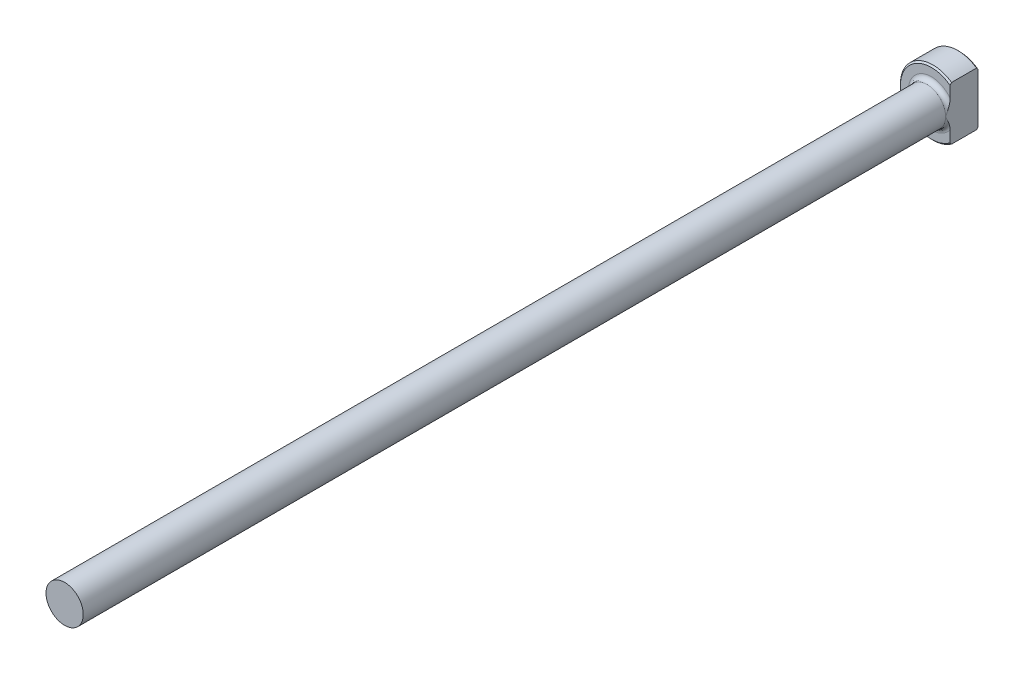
ISO-10303-21;
HEADER;
FILE_DESCRIPTION(('STEP AP214'),'2;1');
FILE_NAME('part.step','',(''),(''),'','','');
FILE_SCHEMA(('AUTOMOTIVE_DESIGN { 1 0 10303 214 1 1 1 1 }'));
ENDSEC;
DATA;
#1=APPLICATION_CONTEXT('core data for automotive mechanical design processes');
#2=APPLICATION_PROTOCOL_DEFINITION('international standard','automotive_design',2000,#1);
#3=PRODUCT_CONTEXT('',#1,'mechanical');
#4=PRODUCT('Part','Part','',(#3));
#5=PRODUCT_RELATED_PRODUCT_CATEGORY('part','',(#4));
#6=PRODUCT_DEFINITION_FORMATION('','',#4);
#7=PRODUCT_DEFINITION_CONTEXT('part definition',#1,'design');
#8=PRODUCT_DEFINITION('design','',#6,#7);
#9=PRODUCT_DEFINITION_SHAPE('','',#8);
#10=(LENGTH_UNIT() NAMED_UNIT(*) SI_UNIT(.MILLI.,.METRE.));
#11=(NAMED_UNIT(*) PLANE_ANGLE_UNIT() SI_UNIT($,.RADIAN.));
#12=(NAMED_UNIT(*) SI_UNIT($,.STERADIAN.) SOLID_ANGLE_UNIT());
#13=UNCERTAINTY_MEASURE_WITH_UNIT(LENGTH_MEASURE(1.E-05),#10,'distance_accuracy_value','');
#14=(GEOMETRIC_REPRESENTATION_CONTEXT(3) GLOBAL_UNCERTAINTY_ASSIGNED_CONTEXT((#13)) GLOBAL_UNIT_ASSIGNED_CONTEXT((#10,
#11,#12)) REPRESENTATION_CONTEXT('',''));
#15=CARTESIAN_POINT('',(0.,0.,0.));
#16=DIRECTION('',(0.,0.,1.));
#17=DIRECTION('',(1.,0.,0.));
#18=AXIS2_PLACEMENT_3D('',#15,#16,#17);
#19=CARTESIAN_POINT('',(0.,0.,0.));
#20=DIRECTION('',(0.,0.,1.));
#21=DIRECTION('',(1.,0.,0.));
#22=AXIS2_PLACEMENT_3D('',#19,#20,#21);
#23=PLANE('',#22);
#24=DIRECTION('',(0.,-1.,0.));
#25=VECTOR('',#24,1.);
#26=CARTESIAN_POINT('',(3.175,4.55200670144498,0.));
#27=LINE('',#26,#25);
#28=CARTESIAN_POINT('',(3.175,4.23862381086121,0.));
#29=VERTEX_POINT('',#28);
#30=CARTESIAN_POINT('',(3.175,-4.23862381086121,0.));
#31=VERTEX_POINT('',#30);
#32=EDGE_CURVE('E194',#29,#31,#27,.T.);
#33=ORIENTED_EDGE('',*,*,#32,.T.);
#34=CARTESIAN_POINT('',(0.,0.,0.));
#35=DIRECTION('',(0.,0.,1.));
#36=DIRECTION('',(1.,0.,0.));
#37=AXIS2_PLACEMENT_3D('',#34,#35,#36);
#38=CIRCLE('',#37,5.29589999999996);
#39=EDGE_CURVE('E11',#31,#29,#38,.F.);
#40=ORIENTED_EDGE('',*,*,#39,.T.);
#41=EDGE_LOOP('',(#33,#40));
#42=FACE_BOUND('',#41,.T.);
#43=ADVANCED_FACE('F34',(#42),#23,.F.);
#44=CARTESIAN_POINT('',(0.,0.,-2.14753999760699));
#45=DIRECTION('',(0.,0.,-1.));
#46=DIRECTION('',(-1.,0.,0.));
#47=AXIS2_PLACEMENT_3D('',#44,#45,#46);
#48=CYLINDRICAL_SURFACE('',#47,5.5499);
#49=DIRECTION('',(0.,0.,-1.));
#50=VECTOR('',#49,1.);
#51=CARTESIAN_POINT('',(3.175,-4.55200670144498,7.62));
#52=LINE('',#51,#50);
#53=CARTESIAN_POINT('',(3.175,-4.55200670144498,4.49580000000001));
#54=VERTEX_POINT('',#53);
#55=CARTESIAN_POINT('',(3.175,-4.55200670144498,0.254000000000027));
#56=VERTEX_POINT('',#55);
#57=EDGE_CURVE('E192',#54,#56,#52,.T.);
#58=ORIENTED_EDGE('',*,*,#57,.F.);
#59=CARTESIAN_POINT('',(0.,0.,4.49580000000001));
#60=DIRECTION('',(0.,0.,-1.));
#61=DIRECTION('',(-1.,0.,0.));
#62=AXIS2_PLACEMENT_3D('',#59,#60,#61);
#63=CIRCLE('',#62,5.5499);
#64=CARTESIAN_POINT('',(3.175,4.55200670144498,4.49580000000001));
#65=VERTEX_POINT('',#64);
#66=EDGE_CURVE('E111',#54,#65,#63,.T.);
#67=ORIENTED_EDGE('',*,*,#66,.T.);
#68=DIRECTION('',(0.,0.,-1.));
#69=VECTOR('',#68,1.);
#70=CARTESIAN_POINT('',(3.175,4.55200670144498,7.62));
#71=LINE('',#70,#69);
#72=CARTESIAN_POINT('',(3.175,4.55200670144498,0.254000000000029));
#73=VERTEX_POINT('',#72);
#74=EDGE_CURVE('E97',#65,#73,#71,.T.);
#75=ORIENTED_EDGE('',*,*,#74,.T.);
#76=CARTESIAN_POINT('',(0.,0.,0.254000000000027));
#77=DIRECTION('',(0.,0.,1.));
#78=DIRECTION('',(1.,0.,0.));
#79=AXIS2_PLACEMENT_3D('',#76,#77,#78);
#80=CIRCLE('',#79,5.5499);
#81=EDGE_CURVE('E108',#73,#56,#80,.T.);
#82=ORIENTED_EDGE('',*,*,#81,.T.);
#83=EDGE_LOOP('',(#58,#67,#75,#82));
#84=FACE_BOUND('',#83,.T.);
#85=ADVANCED_FACE('F170',(#84),#48,.T.);
#86=CARTESIAN_POINT('',(0.,-3.937,4.7498));
#87=DIRECTION('',(0.,0.,-1.));
#88=DIRECTION('',(-1.,0.,0.));
#89=AXIS2_PLACEMENT_3D('',#86,#87,#88);
#90=PLANE('',#89);
#91=DIRECTION('',(0.,-1.,0.));
#92=VECTOR('',#91,1.);
#93=CARTESIAN_POINT('',(3.175,-3.937,4.7498));
#94=LINE('',#93,#92);
#95=CARTESIAN_POINT('',(3.175,4.23862381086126,4.7498));
#96=VERTEX_POINT('',#95);
#97=CARTESIAN_POINT('',(3.175,2.32794845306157,4.7498));
#98=VERTEX_POINT('',#97);
#99=EDGE_CURVE('E106',#96,#98,#94,.T.);
#100=ORIENTED_EDGE('',*,*,#99,.F.);
#101=CARTESIAN_POINT('',(0.,0.,4.7498));
#102=DIRECTION('',(0.,0.,-1.));
#103=DIRECTION('',(-1.,0.,0.));
#104=AXIS2_PLACEMENT_3D('',#101,#102,#103);
#105=CIRCLE('',#104,5.29590000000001);
#106=CARTESIAN_POINT('',(3.175,-4.23862381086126,4.7498));
#107=VERTEX_POINT('',#106);
#108=EDGE_CURVE('E43',#96,#107,#105,.F.);
#109=ORIENTED_EDGE('',*,*,#108,.T.);
#110=CARTESIAN_POINT('',(3.175,-2.32794845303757,4.7498));
#111=VERTEX_POINT('',#110);
#112=EDGE_CURVE('E90',#111,#107,#94,.T.);
#113=ORIENTED_EDGE('',*,*,#112,.F.);
#114=CARTESIAN_POINT('',(0.,0.,4.7498));
#115=DIRECTION('',(0.,0.,-1.));
#116=DIRECTION('',(-1.,0.,0.));
#117=AXIS2_PLACEMENT_3D('',#114,#115,#116);
#118=CIRCLE('',#117,3.937);
#119=EDGE_CURVE('E103',#111,#98,#118,.T.);
#120=ORIENTED_EDGE('',*,*,#119,.T.);
#121=EDGE_LOOP('',(#100,#109,#113,#120));
#122=FACE_BOUND('',#121,.T.);
#123=ADVANCED_FACE('F102',(#122),#90,.F.);
#124=CARTESIAN_POINT('',(0.,0.,5.5118));
#125=DIRECTION('',(0.,0.,-1.));
#126=DIRECTION('',(-1.,0.,0.));
#127=AXIS2_PLACEMENT_3D('',#124,#125,#126);
#128=TOROIDAL_SURFACE('',#127,3.937,0.762);
#129=CARTESIAN_POINT('',(3.175,0.,5.5118));
#130=CARTESIAN_POINT('',(3.175,8.70861715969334E-12,5.51180101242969));
#131=CARTESIAN_POINT('',(3.175,1.64502537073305E-07,5.51180202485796));
#132=CARTESIAN_POINT('',(3.175,7.10670711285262E-07,5.51180399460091));
#133=CARTESIAN_POINT('',(3.175,1.09547584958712E-06,5.51180495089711));
#134=CARTESIAN_POINT('',(3.175,2.02938537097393E-06,5.51180684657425));
#135=CARTESIAN_POINT('',(3.175,2.58665029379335E-06,5.51180778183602));
#136=CARTESIAN_POINT('',(3.175,3.80677368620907E-06,5.51180957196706));
#137=CARTESIAN_POINT('',(3.175,4.46917456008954E-06,5.51181042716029));
#138=CARTESIAN_POINT('',(3.175,6.78713874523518E-06,5.51181319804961));
#139=CARTESIAN_POINT('',(3.175,8.58298314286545E-06,5.51181499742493));
#140=CARTESIAN_POINT('',(3.175,1.23554084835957E-05,5.51181828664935));
#141=CARTESIAN_POINT('',(3.175,1.43270198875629E-05,5.51181978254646));
#142=CARTESIAN_POINT('',(3.175,2.17707854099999E-05,5.51182515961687));
#143=CARTESIAN_POINT('',(3.175,2.74631079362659E-05,5.51182874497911));
#144=CARTESIAN_POINT('',(3.175,3.88864704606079E-05,5.51183483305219));
#145=CARTESIAN_POINT('',(3.175,4.45883312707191E-05,5.5118373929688));
#146=CARTESIAN_POINT('',(3.175,6.81341507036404E-05,5.51184782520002));
#147=CARTESIAN_POINT('',(3.175,8.6078631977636E-05,5.51185544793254));
#148=CARTESIAN_POINT('',(3.175,0.000120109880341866,5.51186811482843));
#149=CARTESIAN_POINT('',(3.175,0.000136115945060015,5.51187336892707));
#150=CARTESIAN_POINT('',(3.175,0.00024914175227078,5.51191372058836));
#151=CARTESIAN_POINT('',(3.175,0.000340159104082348,5.51196353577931));
#152=CARTESIAN_POINT('',(3.175,0.000689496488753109,5.51214743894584));
#153=CARTESIAN_POINT('',(3.175,0.000952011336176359,5.51227059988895));
#154=CARTESIAN_POINT('',(3.175,0.00195505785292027,5.51274854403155));
#155=CARTESIAN_POINT('',(3.175,0.0026912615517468,5.51311475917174));
#156=CARTESIAN_POINT('',(3.175,0.00565526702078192,5.51458164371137));
#157=CARTESIAN_POINT('',(3.175,0.00788786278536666,5.51566948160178));
#158=CARTESIAN_POINT('',(3.17500000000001,0.0409956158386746,5.53181079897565));
#159=CARTESIAN_POINT('',(3.175,0.0718325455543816,5.54696730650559));
#160=CARTESIAN_POINT('',(3.175,0.133963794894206,5.57738379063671));
#161=CARTESIAN_POINT('',(3.175,0.165258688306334,5.59264241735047));
#162=CARTESIAN_POINT('',(3.175,0.256638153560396,5.63705661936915));
#163=CARTESIAN_POINT('',(3.175,0.316774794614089,5.66610886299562));
#164=CARTESIAN_POINT('',(3.175,0.443924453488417,5.72671199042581));
#165=CARTESIAN_POINT('',(3.175,0.510972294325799,5.75818992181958));
#166=CARTESIAN_POINT('',(3.175,0.646262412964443,5.8202456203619));
#167=CARTESIAN_POINT('',(3.175,0.714509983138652,5.85081192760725));
#168=CARTESIAN_POINT('',(3.175,0.835209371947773,5.90308634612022));
#169=CARTESIAN_POINT('',(3.175,0.887504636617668,5.92515415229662));
#170=CARTESIAN_POINT('',(3.175,0.992464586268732,5.96803616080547));
#171=CARTESIAN_POINT('',(3.175,1.04512814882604,5.98885312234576));
#172=CARTESIAN_POINT('',(3.175,1.2018364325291,6.04835229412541));
#173=CARTESIAN_POINT('',(3.175,1.30667807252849,6.0850027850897));
#174=CARTESIAN_POINT('',(3.175,1.47093934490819,6.13589252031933));
#175=CARTESIAN_POINT('',(3.175,1.5295344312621,6.15278774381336));
#176=CARTESIAN_POINT('',(3.175,1.647699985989,6.18393736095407));
#177=CARTESIAN_POINT('',(3.175,1.70727368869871,6.19817932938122));
#178=CARTESIAN_POINT('',(3.175,1.8927371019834,6.23732525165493));
#179=CARTESIAN_POINT('',(3.175,2.01988733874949,6.25685156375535));
#180=CARTESIAN_POINT('',(3.175,2.24840230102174,6.27444838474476));
#181=CARTESIAN_POINT('',(3.175,2.34946674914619,6.27621410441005));
#182=CARTESIAN_POINT('',(3.175,2.54960613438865,6.26435850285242));
#183=CARTESIAN_POINT('',(3.175,2.6486893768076,6.25094730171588));
#184=CARTESIAN_POINT('',(3.175,2.80382229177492,6.21404057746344));
#185=CARTESIAN_POINT('',(3.175,2.86132383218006,6.19667158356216));
#186=CARTESIAN_POINT('',(3.175,2.97342222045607,6.15382370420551));
#187=CARTESIAN_POINT('',(3.175,3.02801546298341,6.12833501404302));
#188=CARTESIAN_POINT('',(3.175,3.12086256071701,6.07471449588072));
#189=CARTESIAN_POINT('',(3.175,3.1601117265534,6.04831782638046));
#190=CARTESIAN_POINT('',(3.175,3.23389307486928,5.98959882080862));
#191=CARTESIAN_POINT('',(3.175,3.26843391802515,5.95728762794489));
#192=CARTESIAN_POINT('',(3.175,3.32421862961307,5.89436919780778));
#193=CARTESIAN_POINT('',(3.175,3.34672516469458,5.86488550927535));
#194=CARTESIAN_POINT('',(3.175,3.38662342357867,5.80260925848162));
#195=CARTESIAN_POINT('',(3.175,3.40401714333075,5.76981799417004));
#196=CARTESIAN_POINT('',(3.175,3.43273943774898,5.70135721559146));
#197=CARTESIAN_POINT('',(3.175,3.44402192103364,5.66566810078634));
#198=CARTESIAN_POINT('',(3.175,3.45946143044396,5.59277846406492));
#199=CARTESIAN_POINT('',(3.175,3.46362358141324,5.55557904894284));
#200=CARTESIAN_POINT('',(3.175,3.46444259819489,5.48570627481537));
#201=CARTESIAN_POINT('',(3.175,3.46196136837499,5.45304023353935));
#202=CARTESIAN_POINT('',(3.175,3.45144381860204,5.38862466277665));
#203=CARTESIAN_POINT('',(3.175,3.44340811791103,5.35687503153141));
#204=CARTESIAN_POINT('',(3.175,3.42243421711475,5.29562528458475));
#205=CARTESIAN_POINT('',(3.175,3.40957621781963,5.26609737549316));
#206=CARTESIAN_POINT('',(3.175,3.37960132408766,5.2093054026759));
#207=CARTESIAN_POINT('',(3.175,3.36248292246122,5.18204214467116));
#208=CARTESIAN_POINT('',(3.175,3.31759977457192,5.1203905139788));
#209=CARTESIAN_POINT('',(3.175,3.28824842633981,5.08715498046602));
#210=CARTESIAN_POINT('',(3.175,3.22451776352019,5.02589411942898));
#211=CARTESIAN_POINT('',(3.175,3.19012727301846,4.99788069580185));
#212=CARTESIAN_POINT('',(3.175,3.10421985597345,4.93746394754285));
#213=CARTESIAN_POINT('',(3.175,3.05110770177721,4.90733654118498));
#214=CARTESIAN_POINT('',(3.175,2.94095120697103,4.85593398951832));
#215=CARTESIAN_POINT('',(3.175,2.88390916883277,4.83465371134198));
#216=CARTESIAN_POINT('',(3.175,2.73802647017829,4.79089983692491));
#217=CARTESIAN_POINT('',(3.175,2.64773712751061,4.77329961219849));
#218=CARTESIAN_POINT('',(3.175,2.46457917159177,4.75190643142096));
#219=CARTESIAN_POINT('',(3.175,2.37169225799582,4.74829780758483));
#220=CARTESIAN_POINT('',(3.175,2.19695020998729,4.75215210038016));
#221=CARTESIAN_POINT('',(3.175,2.11505709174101,4.75838729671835));
#222=CARTESIAN_POINT('',(3.175,1.95213139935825,4.7780705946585));
#223=CARTESIAN_POINT('',(3.175,1.87109935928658,4.79152293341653));
#224=CARTESIAN_POINT('',(3.175,1.71420642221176,4.82347951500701));
#225=CARTESIAN_POINT('',(3.175,1.63828691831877,4.84170340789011));
#226=CARTESIAN_POINT('',(3.175,1.48805923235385,4.88236344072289));
#227=CARTESIAN_POINT('',(3.175,1.41374439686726,4.90477535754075));
#228=CARTESIAN_POINT('',(3.175,1.240037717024,4.96164787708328));
#229=CARTESIAN_POINT('',(3.175,1.14112330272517,4.99755931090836));
#230=CARTESIAN_POINT('',(3.175,0.99311684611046,5.05531060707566));
#231=CARTESIAN_POINT('',(3.175,0.943336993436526,5.07543405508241));
#232=CARTESIAN_POINT('',(3.175,0.844084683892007,5.11674554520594));
#233=CARTESIAN_POINT('',(3.175,0.794613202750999,5.13793593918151));
#234=CARTESIAN_POINT('',(3.175,0.680145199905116,5.18811580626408));
#235=CARTESIAN_POINT('',(3.175,0.615285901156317,5.21741701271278));
#236=CARTESIAN_POINT('',(3.175,0.486664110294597,5.27678520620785));
#237=CARTESIAN_POINT('',(3.175,0.422897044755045,5.3068423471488));
#238=CARTESIAN_POINT('',(3.175,0.30194007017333,5.36464172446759));
#239=CARTESIAN_POINT('',(3.175,0.24472002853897,5.39232093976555));
#240=CARTESIAN_POINT('',(3.175,0.157763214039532,5.43461388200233));
#241=CARTESIAN_POINT('',(3.175,0.12798187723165,5.44913951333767));
#242=CARTESIAN_POINT('',(3.175,0.068852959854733,5.47809107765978));
#243=CARTESIAN_POINT('',(3.17500000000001,0.0395048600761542,5.49251578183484));
#244=CARTESIAN_POINT('',(3.175,0.00788796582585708,5.50793048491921));
#245=CARTESIAN_POINT('',(3.175,0.00565546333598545,5.50901826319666));
#246=CARTESIAN_POINT('',(3.175,0.00269148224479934,5.51048513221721));
#247=CARTESIAN_POINT('',(3.175,0.00195520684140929,5.51085138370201));
#248=CARTESIAN_POINT('',(3.175,0.000952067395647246,5.51132937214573));
#249=CARTESIAN_POINT('',(3.175,0.000689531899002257,5.51145254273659));
#250=CARTESIAN_POINT('',(3.175,0.000340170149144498,5.51163645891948));
#251=CARTESIAN_POINT('',(3.175,0.000249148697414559,5.51168627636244));
#252=CARTESIAN_POINT('',(3.175,0.000136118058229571,5.51172662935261));
#253=CARTESIAN_POINT('',(3.175,0.00012011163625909,5.51173188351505));
#254=CARTESIAN_POINT('',(3.175,8.60796246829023E-05,5.51174455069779));
#255=CARTESIAN_POINT('',(3.175,6.81347467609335E-05,5.51175217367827));
#256=CARTESIAN_POINT('',(3.175,4.45884804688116E-05,5.51176260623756));
#257=CARTESIAN_POINT('',(3.175,3.88865585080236E-05,5.51176516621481));
#258=CARTESIAN_POINT('',(3.175,2.74630844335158E-05,5.51177125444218));
#259=CARTESIAN_POINT('',(3.175,2.17707132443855E-05,5.51177483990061));
#260=CARTESIAN_POINT('',(3.175,1.43269037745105E-05,5.51178021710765));
#261=CARTESIAN_POINT('',(3.175,1.23552872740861E-05,5.51178171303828));
#262=CARTESIAN_POINT('',(3.175,8.5828586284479E-06,5.51178500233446));
#263=CARTESIAN_POINT('',(3.175,6.78701623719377E-06,5.51178680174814));
#264=CARTESIAN_POINT('',(3.175,4.46906307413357E-06,5.51178957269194));
#265=CARTESIAN_POINT('',(3.175,3.80666701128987E-06,5.5117904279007));
#266=CARTESIAN_POINT('',(3.175,2.5865559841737E-06,5.51179221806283));
#267=CARTESIAN_POINT('',(3.175,2.02929863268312E-06,5.51179315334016));
#268=CARTESIAN_POINT('',(3.175,1.09540753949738E-06,5.51179504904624));
#269=CARTESIAN_POINT('',(3.175,7.10612999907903E-07,5.51179600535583));
#270=CARTESIAN_POINT('',(3.175,1.64470323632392E-07,5.51179797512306));
#271=CARTESIAN_POINT('',(3.175,-8.70868654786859E-12,5.51179898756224));
#272=CARTESIAN_POINT('',(3.175,0.,5.5118));
#273=B_SPLINE_CURVE_WITH_KNOTS('',3,(#129,#130,#131,#132,#133,#134,#135,#136,#137,#138,#139,
#140,#141,#142,#143,#144,#145,#146,#147,#148,#149,#150,#151,#152,#153,#154,#155,#156,#157,#158,
#159,#160,#161,#162,#163,#164,#165,#166,#167,#168,#169,#170,#171,#172,#173,#174,#175,#176,#177,
#178,#179,#180,#181,#182,#183,#184,#185,#186,#187,#188,#189,#190,#191,#192,#193,#194,#195,#196,
#197,#198,#199,#200,#201,#202,#203,#204,#205,#206,#207,#208,#209,#210,#211,#212,#213,#214,#215,
#216,#217,#218,#219,#220,#221,#222,#223,#224,#225,#226,#227,#228,#229,#230,#231,#232,#233,#234,
#235,#236,#237,#238,#239,#240,#241,#242,#243,#244,#245,#246,#247,#248,#249,#250,#251,#252,#253,
#254,#255,#256,#257,#258,#259,#260,#261,#262,#263,#264,#265,#266,#267,#268,#269,#270,#271,#272),
.UNSPECIFIED.,.T.,.F.,(4,2,2,2,2,2,2,2,2,2,2,2,2,2,2,2,2,2,2,2,2,2,2,2,2,2,2,2,2,2,2,2,2,2,2,2,
2,2,2,2,2,2,2,2,2,2,2,2,2,2,2,2,2,2,2,2,2,2,2,2,2,2,2,2,2,2,2,2,2,2,2,4),(0.,
3.03403750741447E-06,6.11230082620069E-06,9.36719505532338E-06,1.26082926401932E-05,
2.01972191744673E-05,2.76155741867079E-05,4.77206219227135E-05,6.64529696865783E-05,
0.000124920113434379,0.00017540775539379,0.000485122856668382,0.00135626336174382,
0.00382152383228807,0.0112736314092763,0.114340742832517,0.218794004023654,0.419149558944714,
0.641350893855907,0.865673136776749,1.03594102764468,1.20581838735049,1.53875838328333,
1.72164428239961,1.90536621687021,2.29004905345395,2.59247154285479,2.89075776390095,
3.07049019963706,3.2504404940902,3.39185159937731,3.53299897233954,3.64384237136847,
3.75464244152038,3.86626693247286,3.97781104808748,4.07560557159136,4.17338919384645,
4.26961389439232,4.36587268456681,4.49816239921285,4.63075007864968,4.81292023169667,
4.99498454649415,5.26942965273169,5.54747838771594,5.79349131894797,6.03964884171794,
6.27372503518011,6.50648706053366,6.82199916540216,6.9830725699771,7.14451805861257,
7.35801695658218,7.56949945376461,7.76018514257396,7.85959313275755,7.95768408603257,
7.96513586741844,7.96760136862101,7.9684725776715,7.96878230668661,7.96883279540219,
7.96889126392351,7.96890999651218,7.96893010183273,7.96893752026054,7.96894510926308,
7.96894835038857,7.96895160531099,7.96895468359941,7.9689577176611),.UNSPECIFIED.);
#274=CARTESIAN_POINT('',(3.175,0.,5.5118));
#275=VERTEX_POINT('',#274);
#276=EDGE_CURVE('E93',#98,#275,#273,.T.);
#277=ORIENTED_EDGE('',*,*,#276,.F.);
#278=ORIENTED_EDGE('',*,*,#119,.F.);
#279=CARTESIAN_POINT('',(3.175,0.,5.5118));
#280=CARTESIAN_POINT('',(3.175,-8.70845071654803E-12,5.51179898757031));
#281=CARTESIAN_POINT('',(3.175,-1.64502536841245E-07,5.51179797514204));
#282=CARTESIAN_POINT('',(3.175,-7.1067071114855E-07,5.51179600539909));
#283=CARTESIAN_POINT('',(3.175,-1.09547584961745E-06,5.51179504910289));
#284=CARTESIAN_POINT('',(3.175,-2.02938537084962E-06,5.51179315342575));
#285=CARTESIAN_POINT('',(3.175,-2.58665029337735E-06,5.51179221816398));
#286=CARTESIAN_POINT('',(3.175,-3.80677368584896E-06,5.51179042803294));
#287=CARTESIAN_POINT('',(3.175,-4.46917455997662E-06,5.51178957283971));
#288=CARTESIAN_POINT('',(3.175,-6.78713874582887E-06,5.51178680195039));
#289=CARTESIAN_POINT('',(3.175,-8.58298314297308E-06,5.51178500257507));
#290=CARTESIAN_POINT('',(3.175,-1.23554084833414E-05,5.51178171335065));
#291=CARTESIAN_POINT('',(3.175,-1.43270198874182E-05,5.51178021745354));
#292=CARTESIAN_POINT('',(3.175,-2.17707854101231E-05,5.51177484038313));
#293=CARTESIAN_POINT('',(3.175,-2.7463107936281E-05,5.51177125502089));
#294=CARTESIAN_POINT('',(3.175,-3.88864704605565E-05,5.51176516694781));
#295=CARTESIAN_POINT('',(3.175,-4.4588331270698E-05,5.5117626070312));
#296=CARTESIAN_POINT('',(3.175,-6.81341507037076E-05,5.51175217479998));
#297=CARTESIAN_POINT('',(3.175,-8.60786319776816E-05,5.51174455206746));
#298=CARTESIAN_POINT('',(3.175,-0.000120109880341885,5.51173188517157));
#299=CARTESIAN_POINT('',(3.175,-0.000136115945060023,5.51172663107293));
#300=CARTESIAN_POINT('',(3.175,-0.000249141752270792,5.51168627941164));
#301=CARTESIAN_POINT('',(3.175,-0.000340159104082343,5.51163646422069));
#302=CARTESIAN_POINT('',(3.175,-0.000689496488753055,5.51145256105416));
#303=CARTESIAN_POINT('',(3.175,-0.000952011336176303,5.51132940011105));
#304=CARTESIAN_POINT('',(3.175,-0.0019550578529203,5.51085145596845));
#305=CARTESIAN_POINT('',(3.175,-0.00269126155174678,5.51048524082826));
#306=CARTESIAN_POINT('',(3.175,-0.00565526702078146,5.50901835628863));
#307=CARTESIAN_POINT('',(3.175,-0.00788786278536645,5.50793051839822));
#308=CARTESIAN_POINT('',(3.17500000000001,-0.0409956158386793,5.49178920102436));
#309=CARTESIAN_POINT('',(3.175,-0.0718325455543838,5.47663269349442));
#310=CARTESIAN_POINT('',(3.175,-0.133963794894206,5.44621620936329));
#311=CARTESIAN_POINT('',(3.175,-0.165258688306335,5.43095758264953));
#312=CARTESIAN_POINT('',(3.175,-0.256638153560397,5.38654338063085));
#313=CARTESIAN_POINT('',(3.175,-0.31677479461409,5.35749113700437));
#314=CARTESIAN_POINT('',(3.175,-0.443924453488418,5.29688800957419));
#315=CARTESIAN_POINT('',(3.175,-0.5109722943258,5.26541007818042));
#316=CARTESIAN_POINT('',(3.175,-0.646262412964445,5.2033543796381));
#317=CARTESIAN_POINT('',(3.175,-0.714509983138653,5.17278807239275));
#318=CARTESIAN_POINT('',(3.175,-0.835209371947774,5.12051365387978));
#319=CARTESIAN_POINT('',(3.175,-0.887504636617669,5.09844584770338));
#320=CARTESIAN_POINT('',(3.175,-0.992464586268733,5.05556383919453));
#321=CARTESIAN_POINT('',(3.175,-1.04512814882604,5.03474687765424));
#322=CARTESIAN_POINT('',(3.175,-1.2018364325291,4.97524770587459));
#323=CARTESIAN_POINT('',(3.175,-1.30667807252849,4.93859721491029));
#324=CARTESIAN_POINT('',(3.175,-1.47093934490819,4.88770747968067));
#325=CARTESIAN_POINT('',(3.175,-1.5295344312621,4.87081225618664));
#326=CARTESIAN_POINT('',(3.175,-1.647699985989,4.83966263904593));
#327=CARTESIAN_POINT('',(3.175,-1.70727368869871,4.82542067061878));
#328=CARTESIAN_POINT('',(3.175,-1.8927371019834,4.78627474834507));
#329=CARTESIAN_POINT('',(3.175,-2.01988733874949,4.76674843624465));
#330=CARTESIAN_POINT('',(3.175,-2.24840230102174,4.74915161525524));
#331=CARTESIAN_POINT('',(3.175,-2.34946674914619,4.74738589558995));
#332=CARTESIAN_POINT('',(3.175,-2.54960613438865,4.75924149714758));
#333=CARTESIAN_POINT('',(3.175,-2.6486893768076,4.77265269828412));
#334=CARTESIAN_POINT('',(3.175,-2.80382229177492,4.80955942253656));
#335=CARTESIAN_POINT('',(3.175,-2.86132383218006,4.82692841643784));
#336=CARTESIAN_POINT('',(3.175,-2.97342222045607,4.86977629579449));
#337=CARTESIAN_POINT('',(3.175,-3.02801546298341,4.89526498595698));
#338=CARTESIAN_POINT('',(3.175,-3.12086256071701,4.94888550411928));
#339=CARTESIAN_POINT('',(3.175,-3.1601117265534,4.97528217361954));
#340=CARTESIAN_POINT('',(3.175,-3.23389307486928,5.03400117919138));
#341=CARTESIAN_POINT('',(3.175,-3.26843391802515,5.06631237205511));
#342=CARTESIAN_POINT('',(3.175,-3.32421862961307,5.12923080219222));
#343=CARTESIAN_POINT('',(3.175,-3.34672516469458,5.15871449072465));
#344=CARTESIAN_POINT('',(3.175,-3.38662342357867,5.22099074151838));
#345=CARTESIAN_POINT('',(3.175,-3.40401714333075,5.25378200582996));
#346=CARTESIAN_POINT('',(3.175,-3.43273943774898,5.32224278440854));
#347=CARTESIAN_POINT('',(3.175,-3.44402192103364,5.35793189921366));
#348=CARTESIAN_POINT('',(3.175,-3.45946143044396,5.43082153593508));
#349=CARTESIAN_POINT('',(3.175,-3.46362358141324,5.46802095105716));
#350=CARTESIAN_POINT('',(3.175,-3.46444259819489,5.53789372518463));
#351=CARTESIAN_POINT('',(3.175,-3.46196136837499,5.57055976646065));
#352=CARTESIAN_POINT('',(3.175,-3.45144381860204,5.63497533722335));
#353=CARTESIAN_POINT('',(3.175,-3.44340811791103,5.66672496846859));
#354=CARTESIAN_POINT('',(3.175,-3.42243421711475,5.72797471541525));
#355=CARTESIAN_POINT('',(3.175,-3.40957621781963,5.75750262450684));
#356=CARTESIAN_POINT('',(3.175,-3.37960132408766,5.8142945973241));
#357=CARTESIAN_POINT('',(3.175,-3.36248292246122,5.84155785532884));
#358=CARTESIAN_POINT('',(3.175,-3.31759977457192,5.9032094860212));
#359=CARTESIAN_POINT('',(3.175,-3.28824842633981,5.93644501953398));
#360=CARTESIAN_POINT('',(3.175,-3.22451776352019,5.99770588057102));
#361=CARTESIAN_POINT('',(3.175,-3.19012727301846,6.02571930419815));
#362=CARTESIAN_POINT('',(3.175,-3.10421985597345,6.08613605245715));
#363=CARTESIAN_POINT('',(3.175,-3.05110770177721,6.11626345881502));
#364=CARTESIAN_POINT('',(3.175,-2.94095120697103,6.16766601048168));
#365=CARTESIAN_POINT('',(3.175,-2.88390916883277,6.18894628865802));
#366=CARTESIAN_POINT('',(3.175,-2.73802647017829,6.23270016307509));
#367=CARTESIAN_POINT('',(3.175,-2.64773712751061,6.25030038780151));
#368=CARTESIAN_POINT('',(3.175,-2.46457917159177,6.27169356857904));
#369=CARTESIAN_POINT('',(3.175,-2.37169225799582,6.27530219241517));
#370=CARTESIAN_POINT('',(3.175,-2.19695020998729,6.27144789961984));
#371=CARTESIAN_POINT('',(3.175,-2.11505709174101,6.26521270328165));
#372=CARTESIAN_POINT('',(3.175,-1.95213139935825,6.2455294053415));
#373=CARTESIAN_POINT('',(3.175,-1.87109935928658,6.23207706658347));
#374=CARTESIAN_POINT('',(3.175,-1.71420642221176,6.20012048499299));
#375=CARTESIAN_POINT('',(3.175,-1.63828691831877,6.18189659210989));
#376=CARTESIAN_POINT('',(3.175,-1.48805923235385,6.14123655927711));
#377=CARTESIAN_POINT('',(3.175,-1.41374439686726,6.11882464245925));
#378=CARTESIAN_POINT('',(3.175,-1.240037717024,6.06195212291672));
#379=CARTESIAN_POINT('',(3.175,-1.14112330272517,6.02604068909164));
#380=CARTESIAN_POINT('',(3.175,-0.99311684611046,5.96828939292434));
#381=CARTESIAN_POINT('',(3.175,-0.943336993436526,5.94816594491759));
#382=CARTESIAN_POINT('',(3.175,-0.844084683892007,5.90685445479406));
#383=CARTESIAN_POINT('',(3.175,-0.794613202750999,5.88566406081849));
#384=CARTESIAN_POINT('',(3.175,-0.680145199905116,5.83548419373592));
#385=CARTESIAN_POINT('',(3.175,-0.615285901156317,5.80618298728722));
#386=CARTESIAN_POINT('',(3.175,-0.486664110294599,5.74681479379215));
#387=CARTESIAN_POINT('',(3.175,-0.422897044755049,5.7167576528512));
#388=CARTESIAN_POINT('',(3.175,-0.301940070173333,5.65895827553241));
#389=CARTESIAN_POINT('',(3.175,-0.244720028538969,5.63127906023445));
#390=CARTESIAN_POINT('',(3.175,-0.157763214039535,5.58898611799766));
#391=CARTESIAN_POINT('',(3.175,-0.127981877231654,5.57446048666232));
#392=CARTESIAN_POINT('',(3.175,-0.0688529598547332,5.54550892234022));
#393=CARTESIAN_POINT('',(3.17500000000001,-0.0395048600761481,5.53108421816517));
#394=CARTESIAN_POINT('',(3.175,-0.00788796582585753,5.51566951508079));
#395=CARTESIAN_POINT('',(3.175,-0.00565546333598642,5.51458173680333));
#396=CARTESIAN_POINT('',(3.175,-0.00269148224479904,5.51311486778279));
#397=CARTESIAN_POINT('',(3.175,-0.00195520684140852,5.51274861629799));
#398=CARTESIAN_POINT('',(3.175,-0.000952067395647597,5.51227062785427));
#399=CARTESIAN_POINT('',(3.175,-0.000689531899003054,5.5121474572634));
#400=CARTESIAN_POINT('',(3.175,-0.000340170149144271,5.51196354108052));
#401=CARTESIAN_POINT('',(3.175,-0.000249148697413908,5.51191372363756));
#402=CARTESIAN_POINT('',(3.175,-0.000136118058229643,5.51187337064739));
#403=CARTESIAN_POINT('',(3.175,-0.000120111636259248,5.51186811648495));
#404=CARTESIAN_POINT('',(3.175,-8.60796246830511E-05,5.51185544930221));
#405=CARTESIAN_POINT('',(3.175,-6.81347467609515E-05,5.51184782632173));
#406=CARTESIAN_POINT('',(3.175,-4.45884804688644E-05,5.51183739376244));
#407=CARTESIAN_POINT('',(3.175,-3.88865585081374E-05,5.51183483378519));
#408=CARTESIAN_POINT('',(3.175,-2.74630844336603E-05,5.51182874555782));
#409=CARTESIAN_POINT('',(3.175,-2.17707132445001E-05,5.51182516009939));
#410=CARTESIAN_POINT('',(3.175,-1.43269037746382E-05,5.51181978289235));
#411=CARTESIAN_POINT('',(3.175,-1.23552872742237E-05,5.51181828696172));
#412=CARTESIAN_POINT('',(3.175,-8.58285862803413E-06,5.51181499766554));
#413=CARTESIAN_POINT('',(3.175,-6.78701623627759E-06,5.51181319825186));
#414=CARTESIAN_POINT('',(3.175,-4.46906307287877E-06,5.51181042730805));
#415=CARTESIAN_POINT('',(3.175,-3.80666700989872E-06,5.51180957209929));
#416=CARTESIAN_POINT('',(3.175,-2.5865559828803E-06,5.51180778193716));
#417=CARTESIAN_POINT('',(3.175,-2.02929863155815E-06,5.51180684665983));
#418=CARTESIAN_POINT('',(3.175,-1.09540753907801E-06,5.51180495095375));
#419=CARTESIAN_POINT('',(3.175,-7.10612999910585E-07,5.51180399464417));
#420=CARTESIAN_POINT('',(3.175,-1.64470323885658E-07,5.51180202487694));
#421=CARTESIAN_POINT('',(3.175,8.70852009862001E-12,5.51180101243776));
#422=CARTESIAN_POINT('',(3.175,0.,5.5118));
#423=B_SPLINE_CURVE_WITH_KNOTS('',3,(#279,#280,#281,#282,#283,#284,#285,#286,#287,#288,#289,
#290,#291,#292,#293,#294,#295,#296,#297,#298,#299,#300,#301,#302,#303,#304,#305,#306,#307,#308,
#309,#310,#311,#312,#313,#314,#315,#316,#317,#318,#319,#320,#321,#322,#323,#324,#325,#326,#327,
#328,#329,#330,#331,#332,#333,#334,#335,#336,#337,#338,#339,#340,#341,#342,#343,#344,#345,#346,
#347,#348,#349,#350,#351,#352,#353,#354,#355,#356,#357,#358,#359,#360,#361,#362,#363,#364,#365,
#366,#367,#368,#369,#370,#371,#372,#373,#374,#375,#376,#377,#378,#379,#380,#381,#382,#383,#384,
#385,#386,#387,#388,#389,#390,#391,#392,#393,#394,#395,#396,#397,#398,#399,#400,#401,#402,#403,
#404,#405,#406,#407,#408,#409,#410,#411,#412,#413,#414,#415,#416,#417,#418,#419,#420,#421,#422),
.UNSPECIFIED.,.T.,.F.,(4,2,2,2,2,2,2,2,2,2,2,2,2,2,2,2,2,2,2,2,2,2,2,2,2,2,2,2,2,2,2,2,2,2,2,2,
2,2,2,2,2,2,2,2,2,2,2,2,2,2,2,2,2,2,2,2,2,2,2,2,2,2,2,2,2,2,2,2,2,2,2,4),(0.,
3.0340375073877E-06,6.11230082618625E-06,9.36719505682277E-06,1.26082926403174E-05,
2.01972191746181E-05,2.76155741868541E-05,4.77206219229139E-05,6.6452969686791E-05,
0.000124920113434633,0.000175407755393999,0.00048512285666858,0.00135626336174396,
0.00382152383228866,0.0112736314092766,0.114340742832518,0.218794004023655,0.419149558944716,
0.641350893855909,0.86567313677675,1.03594102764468,1.20581838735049,1.53875838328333,
1.72164428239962,1.90536621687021,2.29004905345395,2.59247154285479,2.89075776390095,
3.07049019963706,3.2504404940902,3.39185159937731,3.53299897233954,3.64384237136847,
3.75464244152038,3.86626693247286,3.97781104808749,4.07560557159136,4.17338919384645,
4.26961389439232,4.36587268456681,4.49816239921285,4.63075007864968,4.81292023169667,
4.99498454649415,5.26942965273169,5.54747838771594,5.79349131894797,6.03964884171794,
6.27372503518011,6.50648706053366,6.82199916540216,6.9830725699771,7.14451805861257,
7.35801695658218,7.56949945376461,7.76018514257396,7.85959313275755,7.95768408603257,
7.96513586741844,7.967601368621,7.9684725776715,7.96878230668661,7.96883279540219,
7.96889126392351,7.96890999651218,7.96893010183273,7.96893752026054,7.96894510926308,
7.96894835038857,7.96895160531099,7.96895468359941,7.96895771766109),.UNSPECIFIED.);
#424=EDGE_CURVE('E86',#275,#111,#423,.T.);
#425=ORIENTED_EDGE('',*,*,#424,.F.);
#426=CARTESIAN_POINT('',(0.,0.,5.5118));
#427=DIRECTION('',(0.,0.,-1.));
#428=DIRECTION('',(-1.,0.,0.));
#429=AXIS2_PLACEMENT_3D('',#426,#427,#428);
#430=CIRCLE('',#429,3.175);
#431=EDGE_CURVE('E109',#275,#275,#430,.T.);
#432=ORIENTED_EDGE('',*,*,#431,.T.);
#433=EDGE_LOOP('',(#277,#278,#425,#432));
#434=FACE_BOUND('',#433,.T.);
#435=ADVANCED_FACE('F107',(#434),#128,.F.);
#436=CARTESIAN_POINT('',(0.,0.,-2.14753999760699));
#437=DIRECTION('',(0.,0.,-1.));
#438=DIRECTION('',(-1.,0.,0.));
#439=AXIS2_PLACEMENT_3D('',#436,#437,#438);
#440=CYLINDRICAL_SURFACE('',#439,3.175);
#441=ORIENTED_EDGE('',*,*,#431,.F.);
#442=EDGE_LOOP('',(#441));
#443=FACE_BOUND('',#442,.T.);
#444=CARTESIAN_POINT('',(0.,0.,152.4));
#445=DIRECTION('',(0.,0.,-1.));
#446=DIRECTION('',(-1.,0.,0.));
#447=AXIS2_PLACEMENT_3D('',#444,#445,#446);
#448=CIRCLE('',#447,3.175);
#449=CARTESIAN_POINT('',(-3.175,0.,152.4));
#450=VERTEX_POINT('',#449);
#451=EDGE_CURVE('E113',#450,#450,#448,.T.);
#452=ORIENTED_EDGE('',*,*,#451,.T.);
#453=EDGE_LOOP('',(#452));
#454=FACE_BOUND('',#453,.T.);
#455=ADVANCED_FACE('F178',(#443,#454),#440,.T.);
#456=CARTESIAN_POINT('',(0.,0.,152.4));
#457=DIRECTION('',(0.,0.,-1.));
#458=DIRECTION('',(-1.,0.,0.));
#459=AXIS2_PLACEMENT_3D('',#456,#457,#458);
#460=PLANE('',#459);
#461=ORIENTED_EDGE('',*,*,#451,.F.);
#462=EDGE_LOOP('',(#461));
#463=FACE_BOUND('',#462,.T.);
#464=ADVANCED_FACE('F134',(#463),#460,.F.);
#465=CARTESIAN_POINT('',(3.175,4.55200670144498,7.62));
#466=DIRECTION('',(1.,0.,0.));
#467=DIRECTION('',(0.,0.,-1.));
#468=AXIS2_PLACEMENT_3D('',#465,#466,#467);
#469=PLANE('',#468);
#470=ORIENTED_EDGE('',*,*,#74,.F.);
#471=CARTESIAN_POINT('',(3.175,4.55200670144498,4.49580000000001));
#472=CARTESIAN_POINT('',(3.175,4.50002950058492,4.53844580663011));
#473=CARTESIAN_POINT('',(3.175,4.447925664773,4.58093537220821));
#474=CARTESIAN_POINT('',(3.175,4.34346470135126,4.66560203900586));
#475=CARTESIAN_POINT('',(3.175,4.29110757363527,4.70777914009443));
#476=CARTESIAN_POINT('',(3.175,4.23862381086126,4.7498));
#477=B_SPLINE_CURVE_WITH_KNOTS('',3,(#471,#472,#473,#474,#475,#476),.UNSPECIFIED.,.F.,.F.,(4,2,
4),(0.,0.201696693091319,0.403393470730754),.UNSPECIFIED.);
#478=EDGE_CURVE('E158',#65,#96,#477,.T.);
#479=ORIENTED_EDGE('',*,*,#478,.T.);
#480=ORIENTED_EDGE('',*,*,#99,.T.);
#481=ORIENTED_EDGE('',*,*,#276,.T.);
#482=ORIENTED_EDGE('',*,*,#424,.T.);
#483=ORIENTED_EDGE('',*,*,#112,.T.);
#484=CARTESIAN_POINT('',(3.175,-4.23862381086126,4.7498));
#485=CARTESIAN_POINT('',(3.175,-4.29110757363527,4.70777914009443));
#486=CARTESIAN_POINT('',(3.175,-4.34346470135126,4.66560203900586));
#487=CARTESIAN_POINT('',(3.175,-4.447925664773,4.58093537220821));
#488=CARTESIAN_POINT('',(3.175,-4.50002950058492,4.53844580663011));
#489=CARTESIAN_POINT('',(3.175,-4.55200670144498,4.49580000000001));
#490=B_SPLINE_CURVE_WITH_KNOTS('',3,(#484,#485,#486,#487,#488,#489),.UNSPECIFIED.,.F.,.F.,(4,2,
4),(0.,0.201696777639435,0.403393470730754),.UNSPECIFIED.);
#491=EDGE_CURVE('E153',#107,#54,#490,.T.);
#492=ORIENTED_EDGE('',*,*,#491,.T.);
#493=ORIENTED_EDGE('',*,*,#57,.T.);
#494=CARTESIAN_POINT('',(3.175,-4.55200670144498,0.254000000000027));
#495=CARTESIAN_POINT('',(3.175,-4.50002950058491,0.211354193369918));
#496=CARTESIAN_POINT('',(3.175,-4.44792566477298,0.168864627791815));
#497=CARTESIAN_POINT('',(3.175,-4.34346470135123,0.084197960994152));
#498=CARTESIAN_POINT('',(3.175,-4.29110757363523,0.0420208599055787));
#499=CARTESIAN_POINT('',(3.175,-4.23862381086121,0.));
#500=B_SPLINE_CURVE_WITH_KNOTS('',3,(#494,#495,#496,#497,#498,#499),.UNSPECIFIED.,.F.,.F.,(4,2,
4),(0.,0.201696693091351,0.40339347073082),.UNSPECIFIED.);
#501=EDGE_CURVE('E50',#56,#31,#500,.T.);
#502=ORIENTED_EDGE('',*,*,#501,.T.);
#503=ORIENTED_EDGE('',*,*,#32,.F.);
#504=CARTESIAN_POINT('',(3.175,4.23862381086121,0.));
#505=CARTESIAN_POINT('',(3.175,4.29110757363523,0.042020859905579));
#506=CARTESIAN_POINT('',(3.175,4.34346470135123,0.0841979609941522));
#507=CARTESIAN_POINT('',(3.175,4.44792566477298,0.168864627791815));
#508=CARTESIAN_POINT('',(3.175,4.50002950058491,0.211354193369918));
#509=CARTESIAN_POINT('',(3.175,4.55200670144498,0.254000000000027));
#510=B_SPLINE_CURVE_WITH_KNOTS('',3,(#504,#505,#506,#507,#508,#509),.UNSPECIFIED.,.F.,.F.,(4,2,
4),(0.,0.201696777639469,0.40339347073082),.UNSPECIFIED.);
#511=EDGE_CURVE('E58',#29,#73,#510,.T.);
#512=ORIENTED_EDGE('',*,*,#511,.T.);
#513=EDGE_LOOP('',(#470,#479,#480,#481,#482,#483,#492,#493,#502,#503,#512));
#514=FACE_BOUND('',#513,.T.);
#515=ADVANCED_FACE('F89',(#514),#469,.T.);
#516=CARTESIAN_POINT('',(0.,0.,4.49580000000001));
#517=DIRECTION('',(0.,0.,-1.));
#518=DIRECTION('',(-1.,0.,0.));
#519=AXIS2_PLACEMENT_3D('',#516,#517,#518);
#520=CONICAL_SURFACE('',#519,5.5499,0.785398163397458);
#521=ORIENTED_EDGE('',*,*,#491,.F.);
#522=ORIENTED_EDGE('',*,*,#108,.F.);
#523=ORIENTED_EDGE('',*,*,#478,.F.);
#524=ORIENTED_EDGE('',*,*,#66,.F.);
#525=EDGE_LOOP('',(#521,#522,#523,#524));
#526=FACE_BOUND('',#525,.T.);
#527=ADVANCED_FACE('F133',(#526),#520,.T.);
#528=CARTESIAN_POINT('',(0.,0.,0.));
#529=DIRECTION('',(0.,0.,1.));
#530=DIRECTION('',(1.,0.,0.));
#531=AXIS2_PLACEMENT_3D('',#528,#529,#530);
#532=CONICAL_SURFACE('',#531,5.29589999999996,0.785398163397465);
#533=ORIENTED_EDGE('',*,*,#501,.F.);
#534=ORIENTED_EDGE('',*,*,#81,.F.);
#535=ORIENTED_EDGE('',*,*,#511,.F.);
#536=ORIENTED_EDGE('',*,*,#39,.F.);
#537=EDGE_LOOP('',(#533,#534,#535,#536));
#538=FACE_BOUND('',#537,.T.);
#539=ADVANCED_FACE('F36',(#538),#532,.T.);
#540=CLOSED_SHELL('',(#43,#85,#123,#435,#455,#464,#515,#527,#539));
#541=MANIFOLD_SOLID_BREP('B2',#540);
#542=ADVANCED_BREP_SHAPE_REPRESENTATION('',(#18,#541),#14);
#543=SHAPE_DEFINITION_REPRESENTATION(#9,#542);
ENDSEC;
END-ISO-10303-21;
